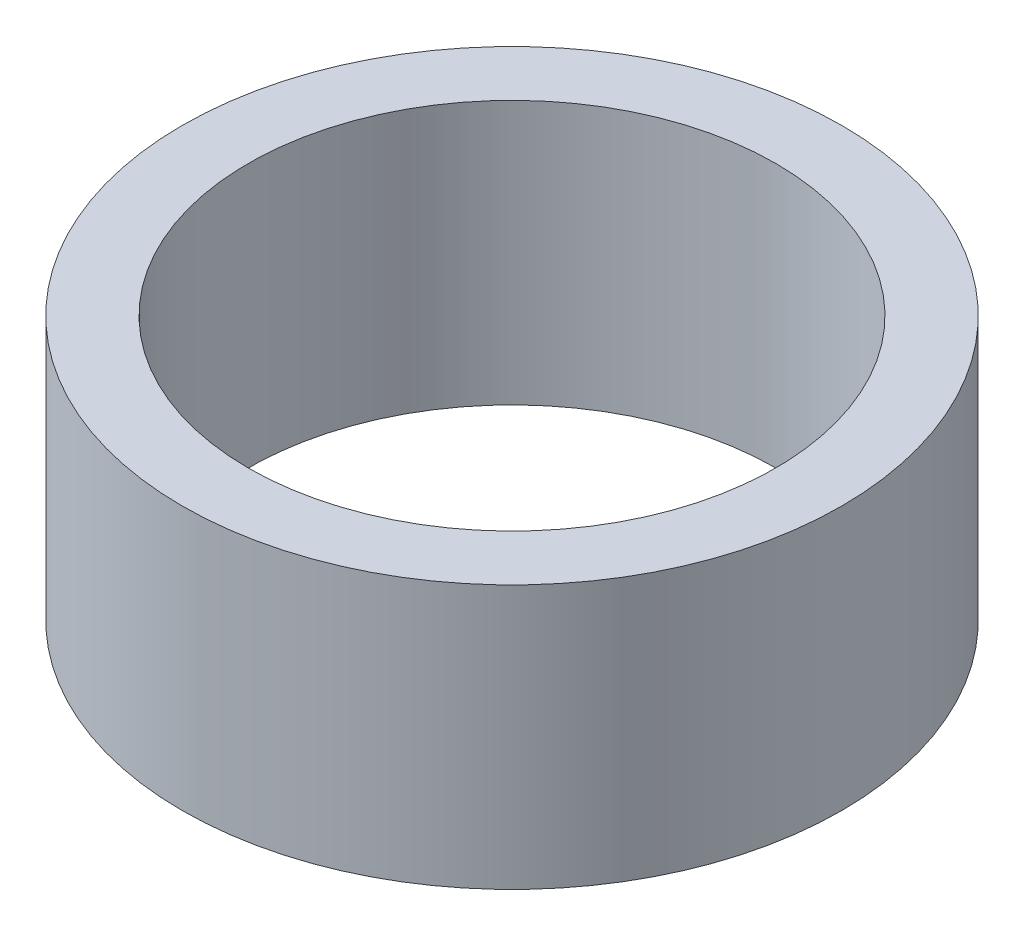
from build123d import *

# Parameters (mm, degrees)
CROQUIS1_R              = 25
CROQUIS1_R_2            = 20
SALIENTE_EXTRUIR1_DEPTH = 20


with BuildPart() as part:
    # Croquis1 → Saliente-Extruir1 (new body)
    with BuildSketch(Plane(origin=(0, 0, 0), x_dir=(1, 0, 0), z_dir=(0, 1, 0))):
        with Locations(Location((0, 0, 0), (0, 0, 270))):
            Circle(CROQUIS1_R)
        with Locations(Location((0, 0, 0), (0, 0, 270))):
            Circle(CROQUIS1_R_2, mode=Mode.SUBTRACT)
    extrude(amount=SALIENTE_EXTRUIR1_DEPTH)


solid = part.part
